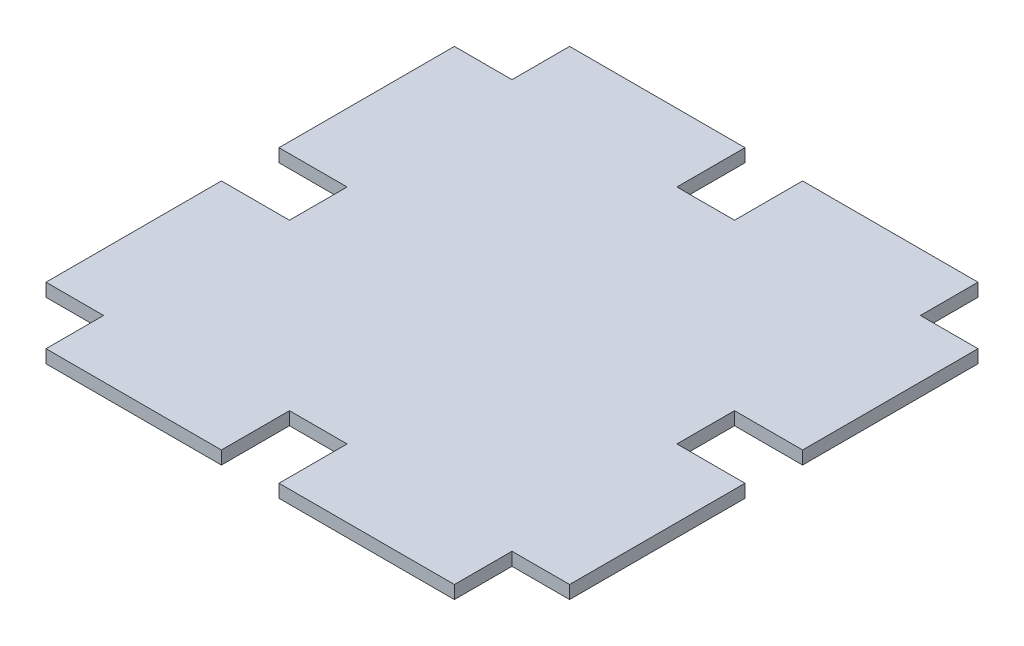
from build123d import *

# Parameters (mm, degrees)
BOSS_EXTRUDE1_DEPTH = 6.35


with BuildPart() as part:
    # Sketch1 → Boss-Extrude1 (new body)
    with BuildSketch(Plane(origin=(0, 0, 0), x_dir=(1, 0, 0), z_dir=(0, 1, 0))):
        Polygon((-13.97, 127), (-99.06, 127), (-99.06, 99.06), (-127, 99.06), (-127, 13.97), (-93.98, 13.97), (-93.98, -13.97), (-127, -13.97), (-127, -99.06), (-99.06, -99.06), (-99.06, -127), (-13.97, -127), (-13.97, -93.98), (13.97, -93.98), (13.97, -127), (99.06, -127), (99.06, -99.06), (127, -99.06), (127, -13.97), (93.98, -13.97), (93.98, 13.97), (127, 13.97), (127, 99.06), (99.06, 99.06), (99.06, 127), (13.97, 127), (13.97, 93.98), (-13.97, 93.98), align=None)
    extrude(amount=BOSS_EXTRUDE1_DEPTH)


solid = part.part
